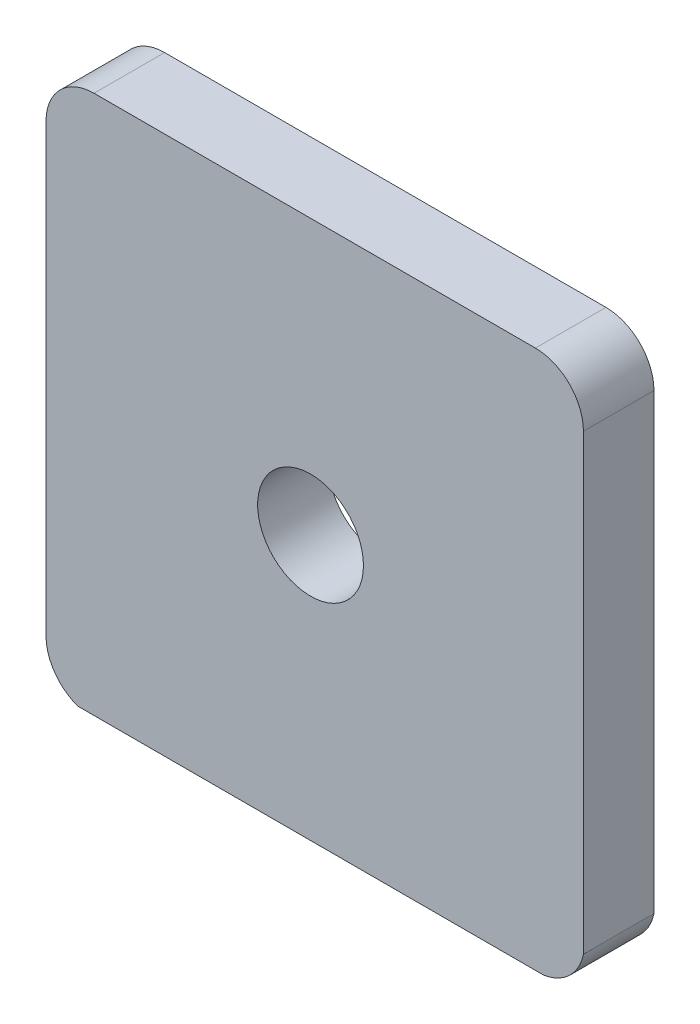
ISO-10303-21;
HEADER;
FILE_DESCRIPTION(('STEP AP214'),'2;1');
FILE_NAME('part.step','',(''),(''),'','','');
FILE_SCHEMA(('AUTOMOTIVE_DESIGN { 1 0 10303 214 1 1 1 1 }'));
ENDSEC;
DATA;
#1=APPLICATION_CONTEXT('core data for automotive mechanical design processes');
#2=APPLICATION_PROTOCOL_DEFINITION('international standard','automotive_design',2000,#1);
#3=PRODUCT_CONTEXT('',#1,'mechanical');
#4=PRODUCT('Part','Part','',(#3));
#5=PRODUCT_RELATED_PRODUCT_CATEGORY('part','',(#4));
#6=PRODUCT_DEFINITION_FORMATION('','',#4);
#7=PRODUCT_DEFINITION_CONTEXT('part definition',#1,'design');
#8=PRODUCT_DEFINITION('design','',#6,#7);
#9=PRODUCT_DEFINITION_SHAPE('','',#8);
#10=(LENGTH_UNIT() NAMED_UNIT(*) SI_UNIT(.MILLI.,.METRE.));
#11=(NAMED_UNIT(*) PLANE_ANGLE_UNIT() SI_UNIT($,.RADIAN.));
#12=(NAMED_UNIT(*) SI_UNIT($,.STERADIAN.) SOLID_ANGLE_UNIT());
#13=UNCERTAINTY_MEASURE_WITH_UNIT(LENGTH_MEASURE(1.E-05),#10,'distance_accuracy_value','');
#14=(GEOMETRIC_REPRESENTATION_CONTEXT(3) GLOBAL_UNCERTAINTY_ASSIGNED_CONTEXT((#13)) GLOBAL_UNIT_ASSIGNED_CONTEXT((#10,
#11,#12)) REPRESENTATION_CONTEXT('',''));
#15=CARTESIAN_POINT('',(0.,0.,0.));
#16=DIRECTION('',(0.,0.,1.));
#17=DIRECTION('',(1.,0.,0.));
#18=AXIS2_PLACEMENT_3D('',#15,#16,#17);
#19=CARTESIAN_POINT('',(-7.79590356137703,8.15236667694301,2.54));
#20=DIRECTION('',(0.,0.,-1.));
#21=DIRECTION('',(-1.,0.,0.));
#22=AXIS2_PLACEMENT_3D('',#19,#20,#21);
#23=CYLINDRICAL_SURFACE('',#22,1.72909643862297);
#24=CARTESIAN_POINT('',(-7.79590356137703,8.15236667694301,0.));
#25=DIRECTION('',(0.,0.,1.));
#26=DIRECTION('',(1.,0.,0.));
#27=AXIS2_PLACEMENT_3D('',#24,#25,#26);
#28=CIRCLE('',#27,1.72909643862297);
#29=CARTESIAN_POINT('',(-7.79590356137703,9.88146311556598,0.));
#30=VERTEX_POINT('',#29);
#31=CARTESIAN_POINT('',(-9.525,8.15236667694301,0.));
#32=VERTEX_POINT('',#31);
#33=EDGE_CURVE('E130',#30,#32,#28,.T.);
#34=ORIENTED_EDGE('',*,*,#33,.T.);
#35=DIRECTION('',(0.,0.,-1.));
#36=VECTOR('',#35,1.);
#37=CARTESIAN_POINT('',(-9.525,8.15236667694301,2.54));
#38=LINE('',#37,#36);
#39=CARTESIAN_POINT('',(-9.525,8.15236667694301,2.54));
#40=VERTEX_POINT('',#39);
#41=EDGE_CURVE('E11',#40,#32,#38,.T.);
#42=ORIENTED_EDGE('',*,*,#41,.F.);
#43=CARTESIAN_POINT('',(-7.79590356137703,8.15236667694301,2.54));
#44=DIRECTION('',(0.,0.,1.));
#45=DIRECTION('',(1.,0.,0.));
#46=AXIS2_PLACEMENT_3D('',#43,#44,#45);
#47=CIRCLE('',#46,1.72909643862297);
#48=CARTESIAN_POINT('',(-7.79590356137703,9.88146311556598,2.54));
#49=VERTEX_POINT('',#48);
#50=EDGE_CURVE('E144',#49,#40,#47,.T.);
#51=ORIENTED_EDGE('',*,*,#50,.F.);
#52=DIRECTION('',(0.,0.,-1.));
#53=VECTOR('',#52,1.);
#54=CARTESIAN_POINT('',(-7.79590356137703,9.88146311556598,2.54));
#55=LINE('',#54,#53);
#56=EDGE_CURVE('E126',#49,#30,#55,.T.);
#57=ORIENTED_EDGE('',*,*,#56,.T.);
#58=EDGE_LOOP('',(#34,#42,#51,#57));
#59=FACE_BOUND('',#58,.T.);
#60=ADVANCED_FACE('F33',(#59),#23,.T.);
#61=CARTESIAN_POINT('',(-9.525,8.15236667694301,2.54));
#62=DIRECTION('',(1.,0.,0.));
#63=DIRECTION('',(0.,1.,0.));
#64=AXIS2_PLACEMENT_3D('',#61,#62,#63);
#65=PLANE('',#64);
#66=DIRECTION('',(0.,-1.,0.));
#67=VECTOR('',#66,1.);
#68=CARTESIAN_POINT('',(-9.525,8.15236667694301,0.));
#69=LINE('',#68,#67);
#70=CARTESIAN_POINT('',(-9.525,-7.97951850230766,0.));
#71=VERTEX_POINT('',#70);
#72=EDGE_CURVE('E133',#32,#71,#69,.T.);
#73=ORIENTED_EDGE('',*,*,#72,.T.);
#74=DIRECTION('',(0.,0.,-1.));
#75=VECTOR('',#74,1.);
#76=CARTESIAN_POINT('',(-9.525,-7.97951850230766,2.54));
#77=LINE('',#76,#75);
#78=CARTESIAN_POINT('',(-9.525,-7.97951850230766,2.54));
#79=VERTEX_POINT('',#78);
#80=EDGE_CURVE('E42',#79,#71,#77,.T.);
#81=ORIENTED_EDGE('',*,*,#80,.F.);
#82=DIRECTION('',(0.,-1.,0.));
#83=VECTOR('',#82,1.);
#84=CARTESIAN_POINT('',(-9.525,8.15236667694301,2.54));
#85=LINE('',#84,#83);
#86=EDGE_CURVE('E93',#40,#79,#85,.T.);
#87=ORIENTED_EDGE('',*,*,#86,.F.);
#88=ORIENTED_EDGE('',*,*,#41,.T.);
#89=EDGE_LOOP('',(#73,#81,#87,#88));
#90=FACE_BOUND('',#89,.T.);
#91=ADVANCED_FACE('F199',(#90),#65,.F.);
#92=CARTESIAN_POINT('',(-7.79781949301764,-7.89814288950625,2.54));
#93=DIRECTION('',(0.,0.,-1.));
#94=DIRECTION('',(-1.,0.,0.));
#95=AXIS2_PLACEMENT_3D('',#92,#93,#94);
#96=CYLINDRICAL_SURFACE('',#95,1.72909643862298);
#97=CARTESIAN_POINT('',(-7.79781949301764,-7.89814288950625,0.));
#98=DIRECTION('',(0.,0.,1.));
#99=DIRECTION('',(1.,0.,0.));
#100=AXIS2_PLACEMENT_3D('',#97,#98,#99);
#101=CIRCLE('',#100,1.72909643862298);
#102=CARTESIAN_POINT('',(-8.383575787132,-9.525,0.));
#103=VERTEX_POINT('',#102);
#104=EDGE_CURVE('E135',#71,#103,#101,.T.);
#105=ORIENTED_EDGE('',*,*,#104,.T.);
#106=DIRECTION('',(0.,0.,-1.));
#107=VECTOR('',#106,1.);
#108=CARTESIAN_POINT('',(-8.383575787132,-9.525,2.54));
#109=LINE('',#108,#107);
#110=CARTESIAN_POINT('',(-8.383575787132,-9.525,2.54));
#111=VERTEX_POINT('',#110);
#112=EDGE_CURVE('E151',#111,#103,#109,.T.);
#113=ORIENTED_EDGE('',*,*,#112,.F.);
#114=CARTESIAN_POINT('',(-7.79781949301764,-7.89814288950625,2.54));
#115=DIRECTION('',(0.,0.,1.));
#116=DIRECTION('',(1.,0.,0.));
#117=AXIS2_PLACEMENT_3D('',#114,#115,#116);
#118=CIRCLE('',#117,1.72909643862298);
#119=EDGE_CURVE('E160',#79,#111,#118,.T.);
#120=ORIENTED_EDGE('',*,*,#119,.F.);
#121=ORIENTED_EDGE('',*,*,#80,.T.);
#122=EDGE_LOOP('',(#105,#113,#120,#121));
#123=FACE_BOUND('',#122,.T.);
#124=ADVANCED_FACE('F158',(#123),#96,.T.);
#125=CARTESIAN_POINT('',(8.39911696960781,-9.52499999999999,2.54));
#126=DIRECTION('',(0.,1.,0.));
#127=DIRECTION('',(-1.,0.,0.));
#128=AXIS2_PLACEMENT_3D('',#125,#126,#127);
#129=PLANE('',#128);
#130=DIRECTION('',(1.,0.,0.));
#131=VECTOR('',#130,1.);
#132=CARTESIAN_POINT('',(8.39911696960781,-9.52499999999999,0.));
#133=LINE('',#132,#131);
#134=CARTESIAN_POINT('',(8.39911696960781,-9.52499999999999,0.));
#135=VERTEX_POINT('',#134);
#136=EDGE_CURVE('E137',#103,#135,#133,.T.);
#137=ORIENTED_EDGE('',*,*,#136,.T.);
#138=DIRECTION('',(0.,0.,-1.));
#139=VECTOR('',#138,1.);
#140=CARTESIAN_POINT('',(8.39911696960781,-9.52499999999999,2.54));
#141=LINE('',#140,#139);
#142=CARTESIAN_POINT('',(8.39911696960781,-9.52499999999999,2.54));
#143=VERTEX_POINT('',#142);
#144=EDGE_CURVE('E148',#143,#135,#141,.T.);
#145=ORIENTED_EDGE('',*,*,#144,.F.);
#146=DIRECTION('',(1.,0.,0.));
#147=VECTOR('',#146,1.);
#148=CARTESIAN_POINT('',(8.39911696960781,-9.52499999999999,2.54));
#149=LINE('',#148,#147);
#150=EDGE_CURVE('E172',#111,#143,#149,.T.);
#151=ORIENTED_EDGE('',*,*,#150,.F.);
#152=ORIENTED_EDGE('',*,*,#112,.T.);
#153=EDGE_LOOP('',(#137,#145,#151,#152));
#154=FACE_BOUND('',#153,.T.);
#155=ADVANCED_FACE('F168',(#154),#129,.F.);
#156=CARTESIAN_POINT('',(8.13131955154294,-7.81676727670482,2.54));
#157=DIRECTION('',(0.,0.,-1.));
#158=DIRECTION('',(-1.,0.,0.));
#159=AXIS2_PLACEMENT_3D('',#156,#157,#158);
#160=CYLINDRICAL_SURFACE('',#159,1.72909643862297);
#161=CARTESIAN_POINT('',(8.13131955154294,-7.81676727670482,0.));
#162=DIRECTION('',(0.,0.,1.));
#163=DIRECTION('',(-1.,0.,0.));
#164=AXIS2_PLACEMENT_3D('',#161,#162,#163);
#165=CIRCLE('',#164,1.72909643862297);
#166=CARTESIAN_POINT('',(9.82650129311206,-8.15755072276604,0.));
#167=VERTEX_POINT('',#166);
#168=EDGE_CURVE('E139',#135,#167,#165,.T.);
#169=ORIENTED_EDGE('',*,*,#168,.T.);
#170=DIRECTION('',(0.,0.,-1.));
#171=VECTOR('',#170,1.);
#172=CARTESIAN_POINT('',(9.82650129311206,-8.15755072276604,2.54));
#173=LINE('',#172,#171);
#174=CARTESIAN_POINT('',(9.82650129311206,-8.15755072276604,2.54));
#175=VERTEX_POINT('',#174);
#176=EDGE_CURVE('E121',#175,#167,#173,.T.);
#177=ORIENTED_EDGE('',*,*,#176,.F.);
#178=CARTESIAN_POINT('',(8.13131955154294,-7.81676727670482,2.54));
#179=DIRECTION('',(0.,0.,1.));
#180=DIRECTION('',(-1.,0.,0.));
#181=AXIS2_PLACEMENT_3D('',#178,#179,#180);
#182=CIRCLE('',#181,1.72909643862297);
#183=EDGE_CURVE('E112',#143,#175,#182,.T.);
#184=ORIENTED_EDGE('',*,*,#183,.F.);
#185=ORIENTED_EDGE('',*,*,#144,.T.);
#186=EDGE_LOOP('',(#169,#177,#184,#185));
#187=FACE_BOUND('',#186,.T.);
#188=ADVANCED_FACE('F171',(#187),#160,.T.);
#189=CARTESIAN_POINT('',(9.82650129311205,8.15236667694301,2.54));
#190=DIRECTION('',(-1.,0.,0.));
#191=DIRECTION('',(0.,-1.,0.));
#192=AXIS2_PLACEMENT_3D('',#189,#190,#191);
#193=PLANE('',#192);
#194=DIRECTION('',(0.,1.,0.));
#195=VECTOR('',#194,1.);
#196=CARTESIAN_POINT('',(9.82650129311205,8.15236667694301,0.));
#197=LINE('',#196,#195);
#198=CARTESIAN_POINT('',(9.82650129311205,8.15236667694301,0.));
#199=VERTEX_POINT('',#198);
#200=EDGE_CURVE('E120',#167,#199,#197,.T.);
#201=ORIENTED_EDGE('',*,*,#200,.T.);
#202=DIRECTION('',(0.,0.,-1.));
#203=VECTOR('',#202,1.);
#204=CARTESIAN_POINT('',(9.82650129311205,8.15236667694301,2.54));
#205=LINE('',#204,#203);
#206=CARTESIAN_POINT('',(9.82650129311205,8.15236667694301,2.54));
#207=VERTEX_POINT('',#206);
#208=EDGE_CURVE('E117',#207,#199,#205,.T.);
#209=ORIENTED_EDGE('',*,*,#208,.F.);
#210=DIRECTION('',(0.,1.,0.));
#211=VECTOR('',#210,1.);
#212=CARTESIAN_POINT('',(9.82650129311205,8.15236667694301,2.54));
#213=LINE('',#212,#211);
#214=EDGE_CURVE('E106',#175,#207,#213,.T.);
#215=ORIENTED_EDGE('',*,*,#214,.F.);
#216=ORIENTED_EDGE('',*,*,#176,.T.);
#217=EDGE_LOOP('',(#201,#209,#215,#216));
#218=FACE_BOUND('',#217,.T.);
#219=ADVANCED_FACE('F118',(#218),#193,.F.);
#220=CARTESIAN_POINT('',(8.09740485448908,8.15236667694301,2.54));
#221=DIRECTION('',(0.,0.,-1.));
#222=DIRECTION('',(-1.,0.,0.));
#223=AXIS2_PLACEMENT_3D('',#220,#221,#222);
#224=CYLINDRICAL_SURFACE('',#223,1.72909643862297);
#225=CARTESIAN_POINT('',(8.09740485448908,8.15236667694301,0.));
#226=DIRECTION('',(0.,0.,1.));
#227=DIRECTION('',(-1.,0.,0.));
#228=AXIS2_PLACEMENT_3D('',#225,#226,#227);
#229=CIRCLE('',#228,1.72909643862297);
#230=CARTESIAN_POINT('',(8.09740485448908,9.88146311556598,0.));
#231=VERTEX_POINT('',#230);
#232=EDGE_CURVE('E79',#199,#231,#229,.T.);
#233=ORIENTED_EDGE('',*,*,#232,.T.);
#234=DIRECTION('',(0.,0.,-1.));
#235=VECTOR('',#234,1.);
#236=CARTESIAN_POINT('',(8.09740485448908,9.88146311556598,2.54));
#237=LINE('',#236,#235);
#238=CARTESIAN_POINT('',(8.09740485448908,9.88146311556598,2.54));
#239=VERTEX_POINT('',#238);
#240=EDGE_CURVE('E122',#239,#231,#237,.T.);
#241=ORIENTED_EDGE('',*,*,#240,.F.);
#242=CARTESIAN_POINT('',(8.09740485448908,8.15236667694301,2.54));
#243=DIRECTION('',(0.,0.,1.));
#244=DIRECTION('',(-1.,0.,0.));
#245=AXIS2_PLACEMENT_3D('',#242,#243,#244);
#246=CIRCLE('',#245,1.72909643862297);
#247=EDGE_CURVE('E110',#207,#239,#246,.T.);
#248=ORIENTED_EDGE('',*,*,#247,.F.);
#249=ORIENTED_EDGE('',*,*,#208,.T.);
#250=EDGE_LOOP('',(#233,#241,#248,#249));
#251=FACE_BOUND('',#250,.T.);
#252=ADVANCED_FACE('F124',(#251),#224,.T.);
#253=CARTESIAN_POINT('',(8.09740485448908,9.88146311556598,2.54));
#254=DIRECTION('',(0.,-1.,0.));
#255=DIRECTION('',(1.,0.,0.));
#256=AXIS2_PLACEMENT_3D('',#253,#254,#255);
#257=PLANE('',#256);
#258=DIRECTION('',(-1.,0.,0.));
#259=VECTOR('',#258,1.);
#260=CARTESIAN_POINT('',(8.09740485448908,9.88146311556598,0.));
#261=LINE('',#260,#259);
#262=EDGE_CURVE('E85',#231,#30,#261,.T.);
#263=ORIENTED_EDGE('',*,*,#262,.T.);
#264=ORIENTED_EDGE('',*,*,#56,.F.);
#265=DIRECTION('',(-1.,0.,0.));
#266=VECTOR('',#265,1.);
#267=CARTESIAN_POINT('',(8.09740485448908,9.88146311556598,2.54));
#268=LINE('',#267,#266);
#269=EDGE_CURVE('E50',#239,#49,#268,.T.);
#270=ORIENTED_EDGE('',*,*,#269,.F.);
#271=ORIENTED_EDGE('',*,*,#240,.T.);
#272=EDGE_LOOP('',(#263,#264,#270,#271));
#273=FACE_BOUND('',#272,.T.);
#274=ADVANCED_FACE('F194',(#273),#257,.F.);
#275=CARTESIAN_POINT('',(-7.79590356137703,8.15236667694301,2.54));
#276=DIRECTION('',(0.,0.,1.));
#277=DIRECTION('',(1.,0.,0.));
#278=AXIS2_PLACEMENT_3D('',#275,#276,#277);
#279=PLANE('',#278);
#280=CARTESIAN_POINT('',(0.,0.,2.54));
#281=DIRECTION('',(0.,0.,1.));
#282=DIRECTION('',(1.,0.,0.));
#283=AXIS2_PLACEMENT_3D('',#280,#281,#282);
#284=CIRCLE('',#283,1.905);
#285=CARTESIAN_POINT('',(1.905,0.,2.54));
#286=VERTEX_POINT('',#285);
#287=EDGE_CURVE('E178',#286,#286,#284,.T.);
#288=ORIENTED_EDGE('',*,*,#287,.F.);
#289=EDGE_LOOP('',(#288));
#290=FACE_BOUND('',#289,.T.);
#291=ORIENTED_EDGE('',*,*,#50,.T.);
#292=ORIENTED_EDGE('',*,*,#86,.T.);
#293=ORIENTED_EDGE('',*,*,#119,.T.);
#294=ORIENTED_EDGE('',*,*,#150,.T.);
#295=ORIENTED_EDGE('',*,*,#183,.T.);
#296=ORIENTED_EDGE('',*,*,#214,.T.);
#297=ORIENTED_EDGE('',*,*,#247,.T.);
#298=ORIENTED_EDGE('',*,*,#269,.T.);
#299=EDGE_LOOP('',(#291,#292,#293,#294,#295,#296,#297,#298));
#300=FACE_BOUND('',#299,.T.);
#301=ADVANCED_FACE('F108',(#290,#300),#279,.T.);
#302=CARTESIAN_POINT('',(-7.79590356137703,8.15236667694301,0.));
#303=DIRECTION('',(0.,0.,1.));
#304=DIRECTION('',(1.,0.,0.));
#305=AXIS2_PLACEMENT_3D('',#302,#303,#304);
#306=PLANE('',#305);
#307=CARTESIAN_POINT('',(0.,0.,0.));
#308=DIRECTION('',(0.,0.,1.));
#309=DIRECTION('',(1.,0.,0.));
#310=AXIS2_PLACEMENT_3D('',#307,#308,#309);
#311=CIRCLE('',#310,1.905);
#312=CARTESIAN_POINT('',(1.905,0.,0.));
#313=VERTEX_POINT('',#312);
#314=EDGE_CURVE('E36',#313,#313,#311,.F.);
#315=ORIENTED_EDGE('',*,*,#314,.F.);
#316=EDGE_LOOP('',(#315));
#317=FACE_BOUND('',#316,.T.);
#318=ORIENTED_EDGE('',*,*,#33,.F.);
#319=ORIENTED_EDGE('',*,*,#262,.F.);
#320=ORIENTED_EDGE('',*,*,#232,.F.);
#321=ORIENTED_EDGE('',*,*,#200,.F.);
#322=ORIENTED_EDGE('',*,*,#168,.F.);
#323=ORIENTED_EDGE('',*,*,#136,.F.);
#324=ORIENTED_EDGE('',*,*,#104,.F.);
#325=ORIENTED_EDGE('',*,*,#72,.F.);
#326=EDGE_LOOP('',(#318,#319,#320,#321,#322,#323,#324,#325));
#327=FACE_BOUND('',#326,.T.);
#328=ADVANCED_FACE('F164',(#317,#327),#306,.F.);
#329=CARTESIAN_POINT('',(0.,0.,2.54));
#330=DIRECTION('',(0.,0.,-1.));
#331=DIRECTION('',(-1.,0.,0.));
#332=AXIS2_PLACEMENT_3D('',#329,#330,#331);
#333=CYLINDRICAL_SURFACE('',#332,1.905);
#334=ORIENTED_EDGE('',*,*,#287,.T.);
#335=EDGE_LOOP('',(#334));
#336=FACE_BOUND('',#335,.T.);
#337=ORIENTED_EDGE('',*,*,#314,.T.);
#338=EDGE_LOOP('',(#337));
#339=FACE_BOUND('',#338,.T.);
#340=ADVANCED_FACE('F185',(#336,#339),#333,.F.);
#341=CLOSED_SHELL('',(#60,#91,#124,#155,#188,#219,#252,#274,#301,#328,#340));
#342=MANIFOLD_SOLID_BREP('B2',#341);
#343=ADVANCED_BREP_SHAPE_REPRESENTATION('',(#18,#342),#14);
#344=SHAPE_DEFINITION_REPRESENTATION(#9,#343);
ENDSEC;
END-ISO-10303-21;
